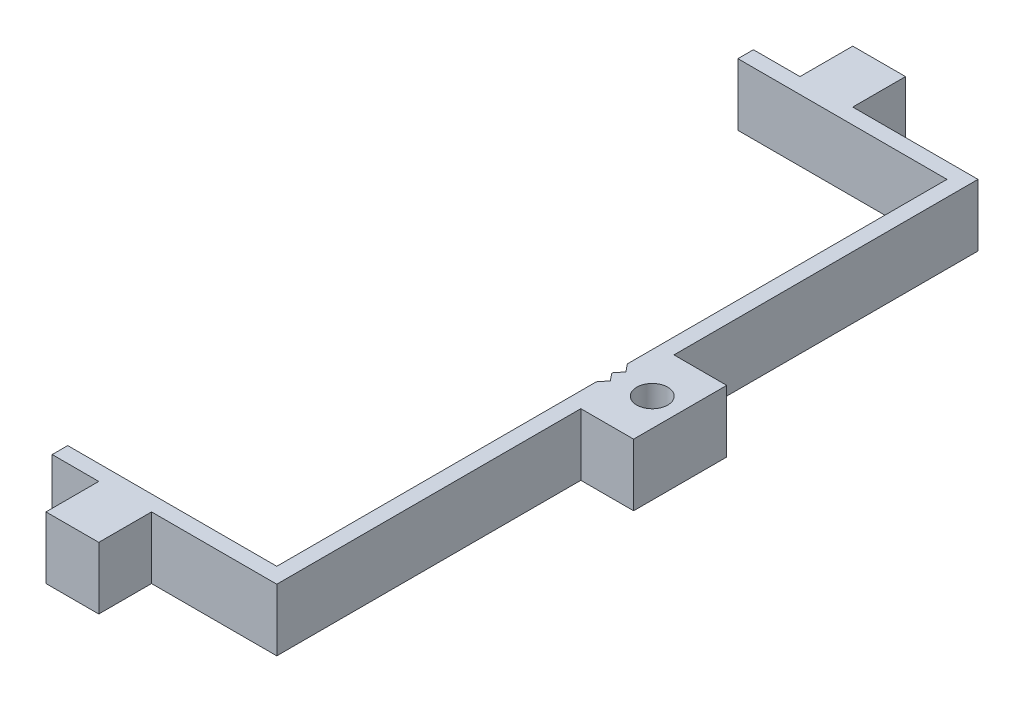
ISO-10303-21;
HEADER;
FILE_DESCRIPTION(('STEP AP214'),'2;1');
FILE_NAME('part.step','',(''),(''),'','','');
FILE_SCHEMA(('AUTOMOTIVE_DESIGN { 1 0 10303 214 1 1 1 1 }'));
ENDSEC;
DATA;
#1=APPLICATION_CONTEXT('core data for automotive mechanical design processes');
#2=APPLICATION_PROTOCOL_DEFINITION('international standard','automotive_design',2000,#1);
#3=PRODUCT_CONTEXT('',#1,'mechanical');
#4=PRODUCT('Part','Part','',(#3));
#5=PRODUCT_RELATED_PRODUCT_CATEGORY('part','',(#4));
#6=PRODUCT_DEFINITION_FORMATION('','',#4);
#7=PRODUCT_DEFINITION_CONTEXT('part definition',#1,'design');
#8=PRODUCT_DEFINITION('design','',#6,#7);
#9=PRODUCT_DEFINITION_SHAPE('','',#8);
#10=(LENGTH_UNIT() NAMED_UNIT(*) SI_UNIT(.MILLI.,.METRE.));
#11=(NAMED_UNIT(*) PLANE_ANGLE_UNIT() SI_UNIT($,.RADIAN.));
#12=(NAMED_UNIT(*) SI_UNIT($,.STERADIAN.) SOLID_ANGLE_UNIT());
#13=UNCERTAINTY_MEASURE_WITH_UNIT(LENGTH_MEASURE(1.E-05),#10,'distance_accuracy_value','');
#14=(GEOMETRIC_REPRESENTATION_CONTEXT(3) GLOBAL_UNCERTAINTY_ASSIGNED_CONTEXT((#13)) GLOBAL_UNIT_ASSIGNED_CONTEXT((#10,
#11,#12)) REPRESENTATION_CONTEXT('',''));
#15=CARTESIAN_POINT('',(0.,0.,0.));
#16=DIRECTION('',(0.,0.,1.));
#17=DIRECTION('',(1.,0.,0.));
#18=AXIS2_PLACEMENT_3D('',#15,#16,#17);
#19=CARTESIAN_POINT('',(87.35,-0.00999999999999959,-112.95));
#20=DIRECTION('',(1.,0.,0.));
#21=DIRECTION('',(0.,0.,-1.));
#22=AXIS2_PLACEMENT_3D('',#19,#20,#21);
#23=PLANE('',#22);
#24=DIRECTION('',(0.,1.,0.));
#25=VECTOR('',#24,1.);
#26=CARTESIAN_POINT('',(87.35,-0.00999999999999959,-112.95));
#27=LINE('',#26,#25);
#28=CARTESIAN_POINT('',(87.35,0.,-112.95));
#29=VERTEX_POINT('',#28);
#30=CARTESIAN_POINT('',(87.35,20.,-112.95));
#31=VERTEX_POINT('',#30);
#32=EDGE_CURVE('E11',#29,#31,#27,.T.);
#33=ORIENTED_EDGE('',*,*,#32,.T.);
#34=DIRECTION('',(0.,0.,-1.));
#35=VECTOR('',#34,1.);
#36=CARTESIAN_POINT('',(87.35,20.,0.));
#37=LINE('',#36,#35);
#38=CARTESIAN_POINT('',(87.35,20.,-129.95));
#39=VERTEX_POINT('',#38);
#40=EDGE_CURVE('E391',#31,#39,#37,.T.);
#41=ORIENTED_EDGE('',*,*,#40,.T.);
#42=DIRECTION('',(0.,-1.,0.));
#43=VECTOR('',#42,1.);
#44=CARTESIAN_POINT('',(87.35,20.,-129.95));
#45=LINE('',#44,#43);
#46=CARTESIAN_POINT('',(87.35,0.,-129.95));
#47=VERTEX_POINT('',#46);
#48=EDGE_CURVE('E365',#39,#47,#45,.T.);
#49=ORIENTED_EDGE('',*,*,#48,.T.);
#50=DIRECTION('',(0.,0.,-1.));
#51=VECTOR('',#50,1.);
#52=CARTESIAN_POINT('',(87.35,0.,0.));
#53=LINE('',#52,#51);
#54=EDGE_CURVE('E358',#29,#47,#53,.T.);
#55=ORIENTED_EDGE('',*,*,#54,.F.);
#56=EDGE_LOOP('',(#33,#41,#49,#55));
#57=FACE_BOUND('',#56,.T.);
#58=ADVANCED_FACE('F37',(#57),#23,.F.);
#59=CARTESIAN_POINT('',(72.35,-0.00999999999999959,-112.95));
#60=DIRECTION('',(1.,0.,0.));
#61=DIRECTION('',(0.,0.,-1.));
#62=AXIS2_PLACEMENT_3D('',#59,#60,#61);
#63=PLANE('',#62);
#64=DIRECTION('',(0.,1.,0.));
#65=VECTOR('',#64,1.);
#66=CARTESIAN_POINT('',(72.35,20.,-107.95));
#67=LINE('',#66,#65);
#68=CARTESIAN_POINT('',(72.35,0.,-107.95));
#69=VERTEX_POINT('',#68);
#70=CARTESIAN_POINT('',(72.35,20.,-107.95));
#71=VERTEX_POINT('',#70);
#72=EDGE_CURVE('E368',#69,#71,#67,.T.);
#73=ORIENTED_EDGE('',*,*,#72,.T.);
#74=DIRECTION('',(0.,0.,-1.));
#75=VECTOR('',#74,1.);
#76=CARTESIAN_POINT('',(72.35,20.,0.));
#77=LINE('',#76,#75);
#78=CARTESIAN_POINT('',(72.35,20.,-112.95));
#79=VERTEX_POINT('',#78);
#80=EDGE_CURVE('E390',#71,#79,#77,.T.);
#81=ORIENTED_EDGE('',*,*,#80,.T.);
#82=DIRECTION('',(0.,1.,0.));
#83=VECTOR('',#82,1.);
#84=CARTESIAN_POINT('',(72.35,-0.00999999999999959,-112.95));
#85=LINE('',#84,#83);
#86=CARTESIAN_POINT('',(72.35,0.,-112.95));
#87=VERTEX_POINT('',#86);
#88=EDGE_CURVE('E46',#87,#79,#85,.T.);
#89=ORIENTED_EDGE('',*,*,#88,.F.);
#90=DIRECTION('',(0.,0.,-1.));
#91=VECTOR('',#90,1.);
#92=CARTESIAN_POINT('',(72.35,0.,0.));
#93=LINE('',#92,#91);
#94=EDGE_CURVE('E381',#69,#87,#93,.T.);
#95=ORIENTED_EDGE('',*,*,#94,.F.);
#96=EDGE_LOOP('',(#73,#81,#89,#95));
#97=FACE_BOUND('',#96,.T.);
#98=ADVANCED_FACE('F416',(#97),#63,.F.);
#99=CARTESIAN_POINT('',(72.35,-0.00999999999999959,-112.95));
#100=DIRECTION('',(0.,0.,1.));
#101=DIRECTION('',(1.,0.,0.));
#102=AXIS2_PLACEMENT_3D('',#99,#100,#101);
#103=PLANE('',#102);
#104=ORIENTED_EDGE('',*,*,#88,.T.);
#105=DIRECTION('',(1.,0.,0.));
#106=VECTOR('',#105,1.);
#107=CARTESIAN_POINT('',(0.,20.,-112.95));
#108=LINE('',#107,#106);
#109=EDGE_CURVE('E394',#79,#31,#108,.T.);
#110=ORIENTED_EDGE('',*,*,#109,.T.);
#111=ORIENTED_EDGE('',*,*,#32,.F.);
#112=DIRECTION('',(1.,0.,0.));
#113=VECTOR('',#112,1.);
#114=CARTESIAN_POINT('',(0.,0.,-112.95));
#115=LINE('',#114,#113);
#116=EDGE_CURVE('E378',#87,#29,#115,.T.);
#117=ORIENTED_EDGE('',*,*,#116,.F.);
#118=EDGE_LOOP('',(#104,#110,#111,#117));
#119=FACE_BOUND('',#118,.T.);
#120=ADVANCED_FACE('F415',(#119),#103,.F.);
#121=CARTESIAN_POINT('',(72.35,-0.00999999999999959,112.95));
#122=DIRECTION('',(-1.,0.,0.));
#123=DIRECTION('',(0.,0.,1.));
#124=AXIS2_PLACEMENT_3D('',#121,#122,#123);
#125=PLANE('',#124);
#126=DIRECTION('',(0.,-1.,0.));
#127=VECTOR('',#126,1.);
#128=CARTESIAN_POINT('',(72.35,20.,107.95));
#129=LINE('',#128,#127);
#130=CARTESIAN_POINT('',(72.35,20.,107.95));
#131=VERTEX_POINT('',#130);
#132=CARTESIAN_POINT('',(72.35,0.,107.95));
#133=VERTEX_POINT('',#132);
#134=EDGE_CURVE('E371',#131,#133,#129,.T.);
#135=ORIENTED_EDGE('',*,*,#134,.T.);
#136=DIRECTION('',(0.,0.,1.));
#137=VECTOR('',#136,1.);
#138=CARTESIAN_POINT('',(72.35,0.,0.));
#139=LINE('',#138,#137);
#140=CARTESIAN_POINT('',(72.35,0.,112.95));
#141=VERTEX_POINT('',#140);
#142=EDGE_CURVE('E41',#133,#141,#139,.T.);
#143=ORIENTED_EDGE('',*,*,#142,.T.);
#144=DIRECTION('',(0.,1.,0.));
#145=VECTOR('',#144,1.);
#146=CARTESIAN_POINT('',(72.35,-0.00999999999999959,112.95));
#147=LINE('',#146,#145);
#148=CARTESIAN_POINT('',(72.35,20.,112.95));
#149=VERTEX_POINT('',#148);
#150=EDGE_CURVE('E402',#141,#149,#147,.T.);
#151=ORIENTED_EDGE('',*,*,#150,.T.);
#152=DIRECTION('',(0.,0.,1.));
#153=VECTOR('',#152,1.);
#154=CARTESIAN_POINT('',(72.35,20.,0.));
#155=LINE('',#154,#153);
#156=EDGE_CURVE('E387',#131,#149,#155,.T.);
#157=ORIENTED_EDGE('',*,*,#156,.F.);
#158=EDGE_LOOP('',(#135,#143,#151,#157));
#159=FACE_BOUND('',#158,.T.);
#160=ADVANCED_FACE('F39',(#159),#125,.T.);
#161=CARTESIAN_POINT('',(87.35,-0.00999999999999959,112.95));
#162=DIRECTION('',(-1.,0.,0.));
#163=DIRECTION('',(0.,0.,1.));
#164=AXIS2_PLACEMENT_3D('',#161,#162,#163);
#165=PLANE('',#164);
#166=DIRECTION('',(0.,1.,0.));
#167=VECTOR('',#166,1.);
#168=CARTESIAN_POINT('',(87.35,-0.00999999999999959,112.95));
#169=LINE('',#168,#167);
#170=CARTESIAN_POINT('',(87.35,0.,112.95));
#171=VERTEX_POINT('',#170);
#172=CARTESIAN_POINT('',(87.35,20.,112.95));
#173=VERTEX_POINT('',#172);
#174=EDGE_CURVE('E400',#171,#173,#169,.T.);
#175=ORIENTED_EDGE('',*,*,#174,.F.);
#176=DIRECTION('',(0.,0.,1.));
#177=VECTOR('',#176,1.);
#178=CARTESIAN_POINT('',(87.35,0.,0.));
#179=LINE('',#178,#177);
#180=CARTESIAN_POINT('',(87.35,0.,129.95));
#181=VERTEX_POINT('',#180);
#182=EDGE_CURVE('E374',#171,#181,#179,.T.);
#183=ORIENTED_EDGE('',*,*,#182,.T.);
#184=DIRECTION('',(0.,1.,0.));
#185=VECTOR('',#184,1.);
#186=CARTESIAN_POINT('',(87.35,20.,129.95));
#187=LINE('',#186,#185);
#188=CARTESIAN_POINT('',(87.35,20.,129.95));
#189=VERTEX_POINT('',#188);
#190=EDGE_CURVE('E362',#181,#189,#187,.T.);
#191=ORIENTED_EDGE('',*,*,#190,.T.);
#192=DIRECTION('',(0.,0.,1.));
#193=VECTOR('',#192,1.);
#194=CARTESIAN_POINT('',(87.35,20.,0.));
#195=LINE('',#194,#193);
#196=EDGE_CURVE('E382',#173,#189,#195,.T.);
#197=ORIENTED_EDGE('',*,*,#196,.F.);
#198=EDGE_LOOP('',(#175,#183,#191,#197));
#199=FACE_BOUND('',#198,.T.);
#200=ADVANCED_FACE('F462',(#199),#165,.T.);
#201=CARTESIAN_POINT('',(72.35,-0.00999999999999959,112.95));
#202=DIRECTION('',(0.,0.,1.));
#203=DIRECTION('',(1.,0.,0.));
#204=AXIS2_PLACEMENT_3D('',#201,#202,#203);
#205=PLANE('',#204);
#206=ORIENTED_EDGE('',*,*,#150,.F.);
#207=DIRECTION('',(1.,0.,0.));
#208=VECTOR('',#207,1.);
#209=CARTESIAN_POINT('',(0.,0.,112.95));
#210=LINE('',#209,#208);
#211=EDGE_CURVE('E375',#141,#171,#210,.T.);
#212=ORIENTED_EDGE('',*,*,#211,.T.);
#213=ORIENTED_EDGE('',*,*,#174,.T.);
#214=DIRECTION('',(1.,0.,0.));
#215=VECTOR('',#214,1.);
#216=CARTESIAN_POINT('',(0.,20.,112.95));
#217=LINE('',#216,#215);
#218=EDGE_CURVE('E384',#149,#173,#217,.T.);
#219=ORIENTED_EDGE('',*,*,#218,.F.);
#220=EDGE_LOOP('',(#206,#212,#213,#219));
#221=FACE_BOUND('',#220,.T.);
#222=ADVANCED_FACE('F465',(#221),#205,.T.);
#223=CARTESIAN_POINT('',(0.,20.,107.95));
#224=DIRECTION('',(0.,0.,1.));
#225=DIRECTION('',(1.,0.,0.));
#226=AXIS2_PLACEMENT_3D('',#223,#224,#225);
#227=PLANE('',#226);
#228=ORIENTED_EDGE('',*,*,#134,.F.);
#229=DIRECTION('',(-1.,0.,0.));
#230=VECTOR('',#229,1.);
#231=CARTESIAN_POINT('',(0.,20.,107.95));
#232=LINE('',#231,#230);
#233=CARTESIAN_POINT('',(139.7,20.,107.95));
#234=VERTEX_POINT('',#233);
#235=EDGE_CURVE('E317',#234,#131,#232,.T.);
#236=ORIENTED_EDGE('',*,*,#235,.F.);
#237=DIRECTION('',(0.,-1.,0.));
#238=VECTOR('',#237,1.);
#239=CARTESIAN_POINT('',(139.7,20.,107.95));
#240=LINE('',#239,#238);
#241=CARTESIAN_POINT('',(139.7,0.,107.95));
#242=VERTEX_POINT('',#241);
#243=EDGE_CURVE('E330',#234,#242,#240,.T.);
#244=ORIENTED_EDGE('',*,*,#243,.T.);
#245=DIRECTION('',(-1.,0.,0.));
#246=VECTOR('',#245,1.);
#247=CARTESIAN_POINT('',(0.,0.,107.95));
#248=LINE('',#247,#246);
#249=EDGE_CURVE('E338',#242,#133,#248,.T.);
#250=ORIENTED_EDGE('',*,*,#249,.T.);
#251=EDGE_LOOP('',(#228,#236,#244,#250));
#252=FACE_BOUND('',#251,.T.);
#253=ADVANCED_FACE('F468',(#252),#227,.F.);
#254=CARTESIAN_POINT('',(0.,20.,129.95));
#255=DIRECTION('',(0.,0.,-1.));
#256=DIRECTION('',(-1.,0.,0.));
#257=AXIS2_PLACEMENT_3D('',#254,#255,#256);
#258=PLANE('',#257);
#259=ORIENTED_EDGE('',*,*,#190,.F.);
#260=DIRECTION('',(1.,0.,0.));
#261=VECTOR('',#260,1.);
#262=CARTESIAN_POINT('',(0.,0.,129.95));
#263=LINE('',#262,#261);
#264=CARTESIAN_POINT('',(104.35,0.,129.95));
#265=VERTEX_POINT('',#264);
#266=EDGE_CURVE('E54',#181,#265,#263,.T.);
#267=ORIENTED_EDGE('',*,*,#266,.T.);
#268=DIRECTION('',(0.,-1.,0.));
#269=VECTOR('',#268,1.);
#270=CARTESIAN_POINT('',(104.35,20.,129.95));
#271=LINE('',#270,#269);
#272=CARTESIAN_POINT('',(104.35,20.,129.95));
#273=VERTEX_POINT('',#272);
#274=EDGE_CURVE('E257',#273,#265,#271,.T.);
#275=ORIENTED_EDGE('',*,*,#274,.F.);
#276=DIRECTION('',(1.,0.,0.));
#277=VECTOR('',#276,1.);
#278=CARTESIAN_POINT('',(0.,20.,129.95));
#279=LINE('',#278,#277);
#280=EDGE_CURVE('E62',#189,#273,#279,.T.);
#281=ORIENTED_EDGE('',*,*,#280,.F.);
#282=EDGE_LOOP('',(#259,#267,#275,#281));
#283=FACE_BOUND('',#282,.T.);
#284=ADVANCED_FACE('F473',(#283),#258,.F.);
#285=CARTESIAN_POINT('',(152.7,20.,0.));
#286=DIRECTION('',(0.,-1.,0.));
#287=DIRECTION('',(0.,0.,-1.));
#288=AXIS2_PLACEMENT_3D('',#285,#286,#287);
#289=CYLINDRICAL_SURFACE('',#288,2.);
#290=CARTESIAN_POINT('',(152.7,0.,0.));
#291=DIRECTION('',(0.,1.,0.));
#292=DIRECTION('',(0.,0.,1.));
#293=AXIS2_PLACEMENT_3D('',#290,#291,#292);
#294=CIRCLE('',#293,2.);
#295=CARTESIAN_POINT('',(152.7,0.,2.));
#296=VERTEX_POINT('',#295);
#297=EDGE_CURVE('E231',#296,#296,#294,.T.);
#298=ORIENTED_EDGE('',*,*,#297,.F.);
#299=EDGE_LOOP('',(#298));
#300=FACE_BOUND('',#299,.T.);
#301=CARTESIAN_POINT('',(152.7,10.,0.));
#302=DIRECTION('',(0.,1.,0.));
#303=DIRECTION('',(0.,0.,1.));
#304=AXIS2_PLACEMENT_3D('',#301,#302,#303);
#305=CIRCLE('',#304,2.);
#306=CARTESIAN_POINT('',(152.7,10.,2.));
#307=VERTEX_POINT('',#306);
#308=EDGE_CURVE('E404',#307,#307,#305,.T.);
#309=ORIENTED_EDGE('',*,*,#308,.T.);
#310=EDGE_LOOP('',(#309));
#311=FACE_BOUND('',#310,.T.);
#312=ADVANCED_FACE('F487',(#300,#311),#289,.F.);
#313=CARTESIAN_POINT('',(144.7,20.,0.));
#314=DIRECTION('',(1.,0.,0.));
#315=DIRECTION('',(0.,0.,-1.));
#316=AXIS2_PLACEMENT_3D('',#313,#314,#315);
#317=PLANE('',#316);
#318=DIRECTION('',(0.,0.,1.));
#319=VECTOR('',#318,1.);
#320=CARTESIAN_POINT('',(144.7,20.,0.));
#321=LINE('',#320,#319);
#322=CARTESIAN_POINT('',(144.7,20.,-112.95));
#323=VERTEX_POINT('',#322);
#324=CARTESIAN_POINT('',(144.7,20.,-15.));
#325=VERTEX_POINT('',#324);
#326=EDGE_CURVE('E319',#323,#325,#321,.T.);
#327=ORIENTED_EDGE('',*,*,#326,.T.);
#328=DIRECTION('',(0.,-1.,0.));
#329=VECTOR('',#328,1.);
#330=CARTESIAN_POINT('',(144.7,20.,-15.));
#331=LINE('',#330,#329);
#332=CARTESIAN_POINT('',(144.7,0.,-15.));
#333=VERTEX_POINT('',#332);
#334=EDGE_CURVE('E250',#325,#333,#331,.T.);
#335=ORIENTED_EDGE('',*,*,#334,.T.);
#336=DIRECTION('',(0.,0.,1.));
#337=VECTOR('',#336,1.);
#338=CARTESIAN_POINT('',(144.7,0.,0.));
#339=LINE('',#338,#337);
#340=CARTESIAN_POINT('',(144.7,0.,-112.95));
#341=VERTEX_POINT('',#340);
#342=EDGE_CURVE('E341',#341,#333,#339,.T.);
#343=ORIENTED_EDGE('',*,*,#342,.F.);
#344=DIRECTION('',(0.,-1.,0.));
#345=VECTOR('',#344,1.);
#346=CARTESIAN_POINT('',(144.7,20.,-112.95));
#347=LINE('',#346,#345);
#348=EDGE_CURVE('E355',#323,#341,#347,.T.);
#349=ORIENTED_EDGE('',*,*,#348,.F.);
#350=EDGE_LOOP('',(#327,#335,#343,#349));
#351=FACE_BOUND('',#350,.T.);
#352=ADVANCED_FACE('F435',(#351),#317,.T.);
#353=CARTESIAN_POINT('',(0.,20.,-112.95));
#354=DIRECTION('',(0.,0.,1.));
#355=DIRECTION('',(1.,0.,0.));
#356=AXIS2_PLACEMENT_3D('',#353,#354,#355);
#357=PLANE('',#356);
#358=DIRECTION('',(0.,-1.,0.));
#359=VECTOR('',#358,1.);
#360=CARTESIAN_POINT('',(104.35,20.,-112.95));
#361=LINE('',#360,#359);
#362=CARTESIAN_POINT('',(104.35,20.,-112.95));
#363=VERTEX_POINT('',#362);
#364=CARTESIAN_POINT('',(104.35,0.,-112.95));
#365=VERTEX_POINT('',#364);
#366=EDGE_CURVE('E273',#363,#365,#361,.T.);
#367=ORIENTED_EDGE('',*,*,#366,.F.);
#368=DIRECTION('',(-1.,0.,0.));
#369=VECTOR('',#368,1.);
#370=CARTESIAN_POINT('',(0.,20.,-112.95));
#371=LINE('',#370,#369);
#372=EDGE_CURVE('E322',#323,#363,#371,.T.);
#373=ORIENTED_EDGE('',*,*,#372,.F.);
#374=ORIENTED_EDGE('',*,*,#348,.T.);
#375=DIRECTION('',(-1.,0.,0.));
#376=VECTOR('',#375,1.);
#377=CARTESIAN_POINT('',(0.,0.,-112.95));
#378=LINE('',#377,#376);
#379=EDGE_CURVE('E344',#341,#365,#378,.T.);
#380=ORIENTED_EDGE('',*,*,#379,.T.);
#381=EDGE_LOOP('',(#367,#373,#374,#380));
#382=FACE_BOUND('',#381,.T.);
#383=ADVANCED_FACE('F432',(#382),#357,.F.);
#384=CARTESIAN_POINT('',(0.,20.,0.));
#385=DIRECTION('',(0.,1.,0.));
#386=DIRECTION('',(0.,0.,1.));
#387=AXIS2_PLACEMENT_3D('',#384,#385,#386);
#388=PLANE('',#387);
#389=ORIENTED_EDGE('',*,*,#80,.F.);
#390=DIRECTION('',(-1.,0.,0.));
#391=VECTOR('',#390,1.);
#392=CARTESIAN_POINT('',(0.,20.,-107.95));
#393=LINE('',#392,#391);
#394=CARTESIAN_POINT('',(139.7,20.,-107.95));
#395=VERTEX_POINT('',#394);
#396=EDGE_CURVE('E309',#395,#71,#393,.T.);
#397=ORIENTED_EDGE('',*,*,#396,.F.);
#398=DIRECTION('',(0.,0.,-1.));
#399=VECTOR('',#398,1.);
#400=CARTESIAN_POINT('',(139.7,20.,0.));
#401=LINE('',#400,#399);
#402=CARTESIAN_POINT('',(139.7,20.,-5.));
#403=VERTEX_POINT('',#402);
#404=EDGE_CURVE('E312',#403,#395,#401,.T.);
#405=ORIENTED_EDGE('',*,*,#404,.F.);
#406=DIRECTION('',(-0.624695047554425,0.,-0.78086880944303));
#407=VECTOR('',#406,1.);
#408=CARTESIAN_POINT('',(141.7,20.,-2.5));
#409=LINE('',#408,#407);
#410=CARTESIAN_POINT('',(141.7,20.,-2.5));
#411=VERTEX_POINT('',#410);
#412=EDGE_CURVE('E294',#411,#403,#409,.T.);
#413=ORIENTED_EDGE('',*,*,#412,.F.);
#414=DIRECTION('',(0.624695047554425,0.,-0.78086880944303));
#415=VECTOR('',#414,1.);
#416=CARTESIAN_POINT('',(139.7,20.,0.));
#417=LINE('',#416,#415);
#418=CARTESIAN_POINT('',(139.7,20.,0.));
#419=VERTEX_POINT('',#418);
#420=EDGE_CURVE('E288',#419,#411,#417,.T.);
#421=ORIENTED_EDGE('',*,*,#420,.F.);
#422=DIRECTION('',(0.624695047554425,0.,0.78086880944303));
#423=VECTOR('',#422,1.);
#424=CARTESIAN_POINT('',(139.7,20.,0.));
#425=LINE('',#424,#423);
#426=CARTESIAN_POINT('',(141.7,20.,2.5));
#427=VERTEX_POINT('',#426);
#428=EDGE_CURVE('E279',#419,#427,#425,.T.);
#429=ORIENTED_EDGE('',*,*,#428,.T.);
#430=DIRECTION('',(-0.624695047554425,0.,0.78086880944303));
#431=VECTOR('',#430,1.);
#432=CARTESIAN_POINT('',(141.7,20.,2.5));
#433=LINE('',#432,#431);
#434=CARTESIAN_POINT('',(139.7,20.,5.));
#435=VERTEX_POINT('',#434);
#436=EDGE_CURVE('E275',#427,#435,#433,.T.);
#437=ORIENTED_EDGE('',*,*,#436,.T.);
#438=EDGE_CURVE('E314',#234,#435,#401,.T.);
#439=ORIENTED_EDGE('',*,*,#438,.F.);
#440=ORIENTED_EDGE('',*,*,#235,.T.);
#441=ORIENTED_EDGE('',*,*,#156,.T.);
#442=ORIENTED_EDGE('',*,*,#218,.T.);
#443=ORIENTED_EDGE('',*,*,#196,.T.);
#444=ORIENTED_EDGE('',*,*,#280,.T.);
#445=DIRECTION('',(0.,0.,1.));
#446=VECTOR('',#445,1.);
#447=CARTESIAN_POINT('',(104.35,20.,0.));
#448=LINE('',#447,#446);
#449=CARTESIAN_POINT('',(104.35,20.,112.95));
#450=VERTEX_POINT('',#449);
#451=EDGE_CURVE('E254',#450,#273,#448,.T.);
#452=ORIENTED_EDGE('',*,*,#451,.F.);
#453=DIRECTION('',(-1.,0.,0.));
#454=VECTOR('',#453,1.);
#455=CARTESIAN_POINT('',(0.,20.,112.95));
#456=LINE('',#455,#454);
#457=CARTESIAN_POINT('',(144.7,20.,112.95));
#458=VERTEX_POINT('',#457);
#459=EDGE_CURVE('E327',#458,#450,#456,.T.);
#460=ORIENTED_EDGE('',*,*,#459,.F.);
#461=CARTESIAN_POINT('',(144.7,20.,15.));
#462=VERTEX_POINT('',#461);
#463=EDGE_CURVE('E230',#462,#458,#321,.T.);
#464=ORIENTED_EDGE('',*,*,#463,.F.);
#465=DIRECTION('',(-1.,0.,0.));
#466=VECTOR('',#465,1.);
#467=CARTESIAN_POINT('',(0.,20.,15.));
#468=LINE('',#467,#466);
#469=CARTESIAN_POINT('',(161.7,20.,15.));
#470=VERTEX_POINT('',#469);
#471=EDGE_CURVE('E210',#470,#462,#468,.T.);
#472=ORIENTED_EDGE('',*,*,#471,.F.);
#473=DIRECTION('',(0.,0.,1.));
#474=VECTOR('',#473,1.);
#475=CARTESIAN_POINT('',(161.7,20.,0.));
#476=LINE('',#475,#474);
#477=CARTESIAN_POINT('',(161.7,20.,-15.));
#478=VERTEX_POINT('',#477);
#479=EDGE_CURVE('E227',#478,#470,#476,.T.);
#480=ORIENTED_EDGE('',*,*,#479,.F.);
#481=DIRECTION('',(1.,0.,0.));
#482=VECTOR('',#481,1.);
#483=CARTESIAN_POINT('',(0.,20.,-15.));
#484=LINE('',#483,#482);
#485=EDGE_CURVE('E234',#325,#478,#484,.T.);
#486=ORIENTED_EDGE('',*,*,#485,.F.);
#487=ORIENTED_EDGE('',*,*,#326,.F.);
#488=ORIENTED_EDGE('',*,*,#372,.T.);
#489=DIRECTION('',(0.,0.,-1.));
#490=VECTOR('',#489,1.);
#491=CARTESIAN_POINT('',(104.35,20.,0.));
#492=LINE('',#491,#490);
#493=CARTESIAN_POINT('',(104.35,20.,-129.95));
#494=VERTEX_POINT('',#493);
#495=EDGE_CURVE('E265',#363,#494,#492,.T.);
#496=ORIENTED_EDGE('',*,*,#495,.T.);
#497=DIRECTION('',(1.,0.,0.));
#498=VECTOR('',#497,1.);
#499=CARTESIAN_POINT('',(0.,20.,-129.95));
#500=LINE('',#499,#498);
#501=EDGE_CURVE('E325',#39,#494,#500,.T.);
#502=ORIENTED_EDGE('',*,*,#501,.F.);
#503=ORIENTED_EDGE('',*,*,#40,.F.);
#504=ORIENTED_EDGE('',*,*,#109,.F.);
#505=EDGE_LOOP('',(#389,#397,#405,#413,#421,#429,#437,#439,#440,#441,#442,#443,#444,#452,#460,
#464,#472,#480,#486,#487,#488,#496,#502,#503,#504));
#506=FACE_BOUND('',#505,.T.);
#507=CARTESIAN_POINT('',(152.7,20.,0.));
#508=DIRECTION('',(0.,1.,0.));
#509=DIRECTION('',(0.,0.,1.));
#510=AXIS2_PLACEMENT_3D('',#507,#508,#509);
#511=CIRCLE('',#510,5.00000000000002);
#512=CARTESIAN_POINT('',(152.7,20.,5.00000000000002));
#513=VERTEX_POINT('',#512);
#514=EDGE_CURVE('E500',#513,#513,#511,.T.);
#515=ORIENTED_EDGE('',*,*,#514,.F.);
#516=EDGE_LOOP('',(#515));
#517=FACE_BOUND('',#516,.T.);
#518=ADVANCED_FACE('F224',(#506,#517),#388,.T.);
#519=CARTESIAN_POINT('',(0.,0.,0.));
#520=DIRECTION('',(0.,1.,0.));
#521=DIRECTION('',(0.,0.,1.));
#522=AXIS2_PLACEMENT_3D('',#519,#520,#521);
#523=PLANE('',#522);
#524=DIRECTION('',(-1.,0.,0.));
#525=VECTOR('',#524,1.);
#526=CARTESIAN_POINT('',(0.,0.,-107.95));
#527=LINE('',#526,#525);
#528=CARTESIAN_POINT('',(139.7,0.,-107.95));
#529=VERTEX_POINT('',#528);
#530=EDGE_CURVE('E304',#529,#69,#527,.T.);
#531=ORIENTED_EDGE('',*,*,#530,.T.);
#532=ORIENTED_EDGE('',*,*,#94,.T.);
#533=ORIENTED_EDGE('',*,*,#116,.T.);
#534=ORIENTED_EDGE('',*,*,#54,.T.);
#535=DIRECTION('',(1.,0.,0.));
#536=VECTOR('',#535,1.);
#537=CARTESIAN_POINT('',(0.,0.,-129.95));
#538=LINE('',#537,#536);
#539=CARTESIAN_POINT('',(104.35,0.,-129.95));
#540=VERTEX_POINT('',#539);
#541=EDGE_CURVE('E347',#47,#540,#538,.T.);
#542=ORIENTED_EDGE('',*,*,#541,.T.);
#543=DIRECTION('',(0.,0.,-1.));
#544=VECTOR('',#543,1.);
#545=CARTESIAN_POINT('',(104.35,0.,0.));
#546=LINE('',#545,#544);
#547=EDGE_CURVE('E264',#365,#540,#546,.T.);
#548=ORIENTED_EDGE('',*,*,#547,.F.);
#549=ORIENTED_EDGE('',*,*,#379,.F.);
#550=ORIENTED_EDGE('',*,*,#342,.T.);
#551=DIRECTION('',(1.,0.,0.));
#552=VECTOR('',#551,1.);
#553=CARTESIAN_POINT('',(0.,0.,-15.));
#554=LINE('',#553,#552);
#555=CARTESIAN_POINT('',(161.7,0.,-15.));
#556=VERTEX_POINT('',#555);
#557=EDGE_CURVE('E244',#333,#556,#554,.T.);
#558=ORIENTED_EDGE('',*,*,#557,.T.);
#559=DIRECTION('',(0.,0.,1.));
#560=VECTOR('',#559,1.);
#561=CARTESIAN_POINT('',(161.7,0.,0.));
#562=LINE('',#561,#560);
#563=CARTESIAN_POINT('',(161.7,0.,15.));
#564=VERTEX_POINT('',#563);
#565=EDGE_CURVE('E241',#556,#564,#562,.T.);
#566=ORIENTED_EDGE('',*,*,#565,.T.);
#567=DIRECTION('',(-1.,0.,0.));
#568=VECTOR('',#567,1.);
#569=CARTESIAN_POINT('',(0.,0.,15.));
#570=LINE('',#569,#568);
#571=CARTESIAN_POINT('',(144.7,0.,15.));
#572=VERTEX_POINT('',#571);
#573=EDGE_CURVE('E213',#564,#572,#570,.T.);
#574=ORIENTED_EDGE('',*,*,#573,.T.);
#575=CARTESIAN_POINT('',(144.7,0.,112.95));
#576=VERTEX_POINT('',#575);
#577=EDGE_CURVE('E340',#572,#576,#339,.T.);
#578=ORIENTED_EDGE('',*,*,#577,.T.);
#579=DIRECTION('',(-1.,0.,0.));
#580=VECTOR('',#579,1.);
#581=CARTESIAN_POINT('',(0.,0.,112.95));
#582=LINE('',#581,#580);
#583=CARTESIAN_POINT('',(104.35,0.,112.95));
#584=VERTEX_POINT('',#583);
#585=EDGE_CURVE('E313',#576,#584,#582,.T.);
#586=ORIENTED_EDGE('',*,*,#585,.T.);
#587=DIRECTION('',(0.,0.,1.));
#588=VECTOR('',#587,1.);
#589=CARTESIAN_POINT('',(104.35,0.,0.));
#590=LINE('',#589,#588);
#591=EDGE_CURVE('E218',#584,#265,#590,.T.);
#592=ORIENTED_EDGE('',*,*,#591,.T.);
#593=ORIENTED_EDGE('',*,*,#266,.F.);
#594=ORIENTED_EDGE('',*,*,#182,.F.);
#595=ORIENTED_EDGE('',*,*,#211,.F.);
#596=ORIENTED_EDGE('',*,*,#142,.F.);
#597=ORIENTED_EDGE('',*,*,#249,.F.);
#598=DIRECTION('',(0.,0.,-1.));
#599=VECTOR('',#598,1.);
#600=CARTESIAN_POINT('',(139.7,0.,0.));
#601=LINE('',#600,#599);
#602=CARTESIAN_POINT('',(139.7,0.,5.));
#603=VERTEX_POINT('',#602);
#604=EDGE_CURVE('E335',#242,#603,#601,.T.);
#605=ORIENTED_EDGE('',*,*,#604,.T.);
#606=DIRECTION('',(-0.624695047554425,0.,0.78086880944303));
#607=VECTOR('',#606,1.);
#608=CARTESIAN_POINT('',(141.7,0.,2.5));
#609=LINE('',#608,#607);
#610=CARTESIAN_POINT('',(141.7,0.,2.5));
#611=VERTEX_POINT('',#610);
#612=EDGE_CURVE('E276',#611,#603,#609,.T.);
#613=ORIENTED_EDGE('',*,*,#612,.F.);
#614=DIRECTION('',(0.624695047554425,0.,0.78086880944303));
#615=VECTOR('',#614,1.);
#616=CARTESIAN_POINT('',(139.7,0.,0.));
#617=LINE('',#616,#615);
#618=CARTESIAN_POINT('',(139.7,0.,0.));
#619=VERTEX_POINT('',#618);
#620=EDGE_CURVE('E278',#619,#611,#617,.T.);
#621=ORIENTED_EDGE('',*,*,#620,.F.);
#622=DIRECTION('',(0.624695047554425,0.,-0.78086880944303));
#623=VECTOR('',#622,1.);
#624=CARTESIAN_POINT('',(139.7,0.,0.));
#625=LINE('',#624,#623);
#626=CARTESIAN_POINT('',(141.7,0.,-2.5));
#627=VERTEX_POINT('',#626);
#628=EDGE_CURVE('E290',#619,#627,#625,.T.);
#629=ORIENTED_EDGE('',*,*,#628,.T.);
#630=DIRECTION('',(-0.624695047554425,0.,-0.78086880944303));
#631=VECTOR('',#630,1.);
#632=CARTESIAN_POINT('',(141.7,0.,-2.5));
#633=LINE('',#632,#631);
#634=CARTESIAN_POINT('',(139.7,0.,-5.));
#635=VERTEX_POINT('',#634);
#636=EDGE_CURVE('E293',#627,#635,#633,.T.);
#637=ORIENTED_EDGE('',*,*,#636,.T.);
#638=EDGE_CURVE('E334',#635,#529,#601,.T.);
#639=ORIENTED_EDGE('',*,*,#638,.T.);
#640=EDGE_LOOP('',(#531,#532,#533,#534,#542,#548,#549,#550,#558,#566,#574,#578,#586,#592,#593,
#594,#595,#596,#597,#605,#613,#621,#629,#637,#639));
#641=FACE_BOUND('',#640,.T.);
#642=ORIENTED_EDGE('',*,*,#297,.T.);
#643=EDGE_LOOP('',(#642));
#644=FACE_BOUND('',#643,.T.);
#645=ADVANCED_FACE('F407',(#641,#644),#523,.F.);
#646=CARTESIAN_POINT('',(139.7,20.,0.));
#647=DIRECTION('',(-1.,0.,0.));
#648=DIRECTION('',(0.,0.,1.));
#649=AXIS2_PLACEMENT_3D('',#646,#647,#648);
#650=PLANE('',#649);
#651=ORIENTED_EDGE('',*,*,#438,.T.);
#652=DIRECTION('',(0.,1.,0.));
#653=VECTOR('',#652,1.);
#654=CARTESIAN_POINT('',(139.7,0.,5.));
#655=LINE('',#654,#653);
#656=EDGE_CURVE('E281',#603,#435,#655,.T.);
#657=ORIENTED_EDGE('',*,*,#656,.F.);
#658=ORIENTED_EDGE('',*,*,#604,.F.);
#659=ORIENTED_EDGE('',*,*,#243,.F.);
#660=EDGE_LOOP('',(#651,#657,#658,#659));
#661=FACE_BOUND('',#660,.T.);
#662=ADVANCED_FACE('F514',(#661),#650,.T.);
#663=CARTESIAN_POINT('',(0.,20.,-107.95));
#664=DIRECTION('',(0.,0.,1.));
#665=DIRECTION('',(1.,0.,0.));
#666=AXIS2_PLACEMENT_3D('',#663,#664,#665);
#667=PLANE('',#666);
#668=ORIENTED_EDGE('',*,*,#72,.F.);
#669=ORIENTED_EDGE('',*,*,#530,.F.);
#670=DIRECTION('',(0.,-1.,0.));
#671=VECTOR('',#670,1.);
#672=CARTESIAN_POINT('',(139.7,20.,-107.95));
#673=LINE('',#672,#671);
#674=EDGE_CURVE('E356',#395,#529,#673,.T.);
#675=ORIENTED_EDGE('',*,*,#674,.F.);
#676=ORIENTED_EDGE('',*,*,#396,.T.);
#677=EDGE_LOOP('',(#668,#669,#675,#676));
#678=FACE_BOUND('',#677,.T.);
#679=ADVANCED_FACE('F459',(#678),#667,.T.);
#680=DIRECTION('',(0.,1.,0.));
#681=VECTOR('',#680,1.);
#682=CARTESIAN_POINT('',(139.7,0.,-5.));
#683=LINE('',#682,#681);
#684=EDGE_CURVE('E301',#635,#403,#683,.T.);
#685=ORIENTED_EDGE('',*,*,#684,.T.);
#686=ORIENTED_EDGE('',*,*,#404,.T.);
#687=ORIENTED_EDGE('',*,*,#674,.T.);
#688=ORIENTED_EDGE('',*,*,#638,.F.);
#689=EDGE_LOOP('',(#685,#686,#687,#688));
#690=FACE_BOUND('',#689,.T.);
#691=ADVANCED_FACE('F528',(#690),#650,.T.);
#692=DIRECTION('',(0.,-1.,0.));
#693=VECTOR('',#692,1.);
#694=CARTESIAN_POINT('',(144.7,20.,15.));
#695=LINE('',#694,#693);
#696=EDGE_CURVE('E236',#462,#572,#695,.T.);
#697=ORIENTED_EDGE('',*,*,#696,.F.);
#698=ORIENTED_EDGE('',*,*,#463,.T.);
#699=DIRECTION('',(0.,-1.,0.));
#700=VECTOR('',#699,1.);
#701=CARTESIAN_POINT('',(144.7,20.,112.95));
#702=LINE('',#701,#700);
#703=EDGE_CURVE('E352',#458,#576,#702,.T.);
#704=ORIENTED_EDGE('',*,*,#703,.T.);
#705=ORIENTED_EDGE('',*,*,#577,.F.);
#706=EDGE_LOOP('',(#697,#698,#704,#705));
#707=FACE_BOUND('',#706,.T.);
#708=ADVANCED_FACE('F495',(#707),#317,.T.);
#709=CARTESIAN_POINT('',(0.,20.,-129.95));
#710=DIRECTION('',(0.,0.,-1.));
#711=DIRECTION('',(-1.,0.,0.));
#712=AXIS2_PLACEMENT_3D('',#709,#710,#711);
#713=PLANE('',#712);
#714=ORIENTED_EDGE('',*,*,#48,.F.);
#715=ORIENTED_EDGE('',*,*,#501,.T.);
#716=DIRECTION('',(0.,-1.,0.));
#717=VECTOR('',#716,1.);
#718=CARTESIAN_POINT('',(104.35,20.,-129.95));
#719=LINE('',#718,#717);
#720=EDGE_CURVE('E268',#494,#540,#719,.T.);
#721=ORIENTED_EDGE('',*,*,#720,.T.);
#722=ORIENTED_EDGE('',*,*,#541,.F.);
#723=EDGE_LOOP('',(#714,#715,#721,#722));
#724=FACE_BOUND('',#723,.T.);
#725=ADVANCED_FACE('F426',(#724),#713,.T.);
#726=CARTESIAN_POINT('',(0.,20.,112.95));
#727=DIRECTION('',(0.,0.,1.));
#728=DIRECTION('',(1.,0.,0.));
#729=AXIS2_PLACEMENT_3D('',#726,#727,#728);
#730=PLANE('',#729);
#731=DIRECTION('',(0.,-1.,0.));
#732=VECTOR('',#731,1.);
#733=CARTESIAN_POINT('',(104.35,20.,112.95));
#734=LINE('',#733,#732);
#735=EDGE_CURVE('E261',#450,#584,#734,.T.);
#736=ORIENTED_EDGE('',*,*,#735,.T.);
#737=ORIENTED_EDGE('',*,*,#585,.F.);
#738=ORIENTED_EDGE('',*,*,#703,.F.);
#739=ORIENTED_EDGE('',*,*,#459,.T.);
#740=EDGE_LOOP('',(#736,#737,#738,#739));
#741=FACE_BOUND('',#740,.T.);
#742=ADVANCED_FACE('F521',(#741),#730,.T.);
#743=CARTESIAN_POINT('',(141.7,0.,-2.5));
#744=DIRECTION('',(0.78086880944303,0.,-0.624695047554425));
#745=DIRECTION('',(-0.624695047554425,0.,-0.78086880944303));
#746=AXIS2_PLACEMENT_3D('',#743,#744,#745);
#747=PLANE('',#746);
#748=ORIENTED_EDGE('',*,*,#412,.T.);
#749=ORIENTED_EDGE('',*,*,#684,.F.);
#750=ORIENTED_EDGE('',*,*,#636,.F.);
#751=DIRECTION('',(0.,1.,0.));
#752=VECTOR('',#751,1.);
#753=CARTESIAN_POINT('',(141.7,0.,-2.5));
#754=LINE('',#753,#752);
#755=EDGE_CURVE('E305',#627,#411,#754,.T.);
#756=ORIENTED_EDGE('',*,*,#755,.T.);
#757=EDGE_LOOP('',(#748,#749,#750,#756));
#758=FACE_BOUND('',#757,.T.);
#759=ADVANCED_FACE('F523',(#758),#747,.F.);
#760=CARTESIAN_POINT('',(139.7,0.,0.));
#761=DIRECTION('',(0.78086880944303,0.,0.624695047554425));
#762=DIRECTION('',(0.624695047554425,0.,-0.78086880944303));
#763=AXIS2_PLACEMENT_3D('',#760,#761,#762);
#764=PLANE('',#763);
#765=ORIENTED_EDGE('',*,*,#420,.T.);
#766=ORIENTED_EDGE('',*,*,#755,.F.);
#767=ORIENTED_EDGE('',*,*,#628,.F.);
#768=DIRECTION('',(0.,1.,0.));
#769=VECTOR('',#768,1.);
#770=CARTESIAN_POINT('',(139.7,0.,0.));
#771=LINE('',#770,#769);
#772=EDGE_CURVE('E297',#619,#419,#771,.T.);
#773=ORIENTED_EDGE('',*,*,#772,.T.);
#774=EDGE_LOOP('',(#765,#766,#767,#773));
#775=FACE_BOUND('',#774,.T.);
#776=ADVANCED_FACE('F518',(#775),#764,.F.);
#777=CARTESIAN_POINT('',(139.7,0.,0.));
#778=DIRECTION('',(-0.78086880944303,0.,0.624695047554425));
#779=DIRECTION('',(0.624695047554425,0.,0.78086880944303));
#780=AXIS2_PLACEMENT_3D('',#777,#778,#779);
#781=PLANE('',#780);
#782=ORIENTED_EDGE('',*,*,#428,.F.);
#783=ORIENTED_EDGE('',*,*,#772,.F.);
#784=ORIENTED_EDGE('',*,*,#620,.T.);
#785=DIRECTION('',(0.,1.,0.));
#786=VECTOR('',#785,1.);
#787=CARTESIAN_POINT('',(141.7,0.,2.5));
#788=LINE('',#787,#786);
#789=EDGE_CURVE('E286',#611,#427,#788,.T.);
#790=ORIENTED_EDGE('',*,*,#789,.T.);
#791=EDGE_LOOP('',(#782,#783,#784,#790));
#792=FACE_BOUND('',#791,.T.);
#793=ADVANCED_FACE('F551',(#792),#781,.T.);
#794=CARTESIAN_POINT('',(141.7,0.,2.5));
#795=DIRECTION('',(-0.78086880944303,0.,-0.624695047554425));
#796=DIRECTION('',(-0.624695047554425,0.,0.78086880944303));
#797=AXIS2_PLACEMENT_3D('',#794,#795,#796);
#798=PLANE('',#797);
#799=ORIENTED_EDGE('',*,*,#436,.F.);
#800=ORIENTED_EDGE('',*,*,#789,.F.);
#801=ORIENTED_EDGE('',*,*,#612,.T.);
#802=ORIENTED_EDGE('',*,*,#656,.T.);
#803=EDGE_LOOP('',(#799,#800,#801,#802));
#804=FACE_BOUND('',#803,.T.);
#805=ADVANCED_FACE('F559',(#804),#798,.T.);
#806=CARTESIAN_POINT('',(104.35,20.,0.));
#807=DIRECTION('',(-1.,0.,0.));
#808=DIRECTION('',(0.,0.,1.));
#809=AXIS2_PLACEMENT_3D('',#806,#807,#808);
#810=PLANE('',#809);
#811=ORIENTED_EDGE('',*,*,#547,.T.);
#812=ORIENTED_EDGE('',*,*,#720,.F.);
#813=ORIENTED_EDGE('',*,*,#495,.F.);
#814=ORIENTED_EDGE('',*,*,#366,.T.);
#815=EDGE_LOOP('',(#811,#812,#813,#814));
#816=FACE_BOUND('',#815,.T.);
#817=ADVANCED_FACE('F428',(#816),#810,.F.);
#818=CARTESIAN_POINT('',(104.35,20.,0.));
#819=DIRECTION('',(1.,0.,0.));
#820=DIRECTION('',(0.,0.,-1.));
#821=AXIS2_PLACEMENT_3D('',#818,#819,#820);
#822=PLANE('',#821);
#823=ORIENTED_EDGE('',*,*,#591,.F.);
#824=ORIENTED_EDGE('',*,*,#735,.F.);
#825=ORIENTED_EDGE('',*,*,#451,.T.);
#826=ORIENTED_EDGE('',*,*,#274,.T.);
#827=EDGE_LOOP('',(#823,#824,#825,#826));
#828=FACE_BOUND('',#827,.T.);
#829=ADVANCED_FACE('F571',(#828),#822,.T.);
#830=CARTESIAN_POINT('',(0.,20.,15.));
#831=DIRECTION('',(0.,0.,1.));
#832=DIRECTION('',(1.,0.,0.));
#833=AXIS2_PLACEMENT_3D('',#830,#831,#832);
#834=PLANE('',#833);
#835=ORIENTED_EDGE('',*,*,#573,.F.);
#836=DIRECTION('',(0.,-1.,0.));
#837=VECTOR('',#836,1.);
#838=CARTESIAN_POINT('',(161.7,20.,15.));
#839=LINE('',#838,#837);
#840=EDGE_CURVE('E207',#470,#564,#839,.T.);
#841=ORIENTED_EDGE('',*,*,#840,.F.);
#842=ORIENTED_EDGE('',*,*,#471,.T.);
#843=ORIENTED_EDGE('',*,*,#696,.T.);
#844=EDGE_LOOP('',(#835,#841,#842,#843));
#845=FACE_BOUND('',#844,.T.);
#846=ADVANCED_FACE('F209',(#845),#834,.T.);
#847=CARTESIAN_POINT('',(161.7,20.,0.));
#848=DIRECTION('',(1.,0.,0.));
#849=DIRECTION('',(0.,0.,-1.));
#850=AXIS2_PLACEMENT_3D('',#847,#848,#849);
#851=PLANE('',#850);
#852=ORIENTED_EDGE('',*,*,#565,.F.);
#853=DIRECTION('',(0.,-1.,0.));
#854=VECTOR('',#853,1.);
#855=CARTESIAN_POINT('',(161.7,20.,-15.));
#856=LINE('',#855,#854);
#857=EDGE_CURVE('E219',#478,#556,#856,.T.);
#858=ORIENTED_EDGE('',*,*,#857,.F.);
#859=ORIENTED_EDGE('',*,*,#479,.T.);
#860=ORIENTED_EDGE('',*,*,#840,.T.);
#861=EDGE_LOOP('',(#852,#858,#859,#860));
#862=FACE_BOUND('',#861,.T.);
#863=ADVANCED_FACE('F233',(#862),#851,.T.);
#864=CARTESIAN_POINT('',(0.,20.,-15.));
#865=DIRECTION('',(0.,0.,-1.));
#866=DIRECTION('',(-1.,0.,0.));
#867=AXIS2_PLACEMENT_3D('',#864,#865,#866);
#868=PLANE('',#867);
#869=ORIENTED_EDGE('',*,*,#557,.F.);
#870=ORIENTED_EDGE('',*,*,#334,.F.);
#871=ORIENTED_EDGE('',*,*,#485,.T.);
#872=ORIENTED_EDGE('',*,*,#857,.T.);
#873=EDGE_LOOP('',(#869,#870,#871,#872));
#874=FACE_BOUND('',#873,.T.);
#875=ADVANCED_FACE('F438',(#874),#868,.T.);
#876=CARTESIAN_POINT('',(152.7,10.,0.));
#877=DIRECTION('',(0.,1.,0.));
#878=DIRECTION('',(0.,0.,1.));
#879=AXIS2_PLACEMENT_3D('',#876,#877,#878);
#880=CYLINDRICAL_SURFACE('',#879,5.00000000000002);
#881=CARTESIAN_POINT('',(152.7,10.,0.));
#882=DIRECTION('',(0.,1.,0.));
#883=DIRECTION('',(0.,0.,1.));
#884=AXIS2_PLACEMENT_3D('',#881,#882,#883);
#885=CIRCLE('',#884,5.00000000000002);
#886=CARTESIAN_POINT('',(152.7,10.,5.00000000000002));
#887=VERTEX_POINT('',#886);
#888=EDGE_CURVE('E242',#887,#887,#885,.T.);
#889=ORIENTED_EDGE('',*,*,#888,.F.);
#890=EDGE_LOOP('',(#889));
#891=FACE_BOUND('',#890,.T.);
#892=ORIENTED_EDGE('',*,*,#514,.T.);
#893=EDGE_LOOP('',(#892));
#894=FACE_BOUND('',#893,.T.);
#895=ADVANCED_FACE('F440',(#891,#894),#880,.F.);
#896=CARTESIAN_POINT('',(152.7,10.,0.));
#897=DIRECTION('',(0.,1.,0.));
#898=DIRECTION('',(0.,0.,1.));
#899=AXIS2_PLACEMENT_3D('',#896,#897,#898);
#900=PLANE('',#899);
#901=ORIENTED_EDGE('',*,*,#308,.F.);
#902=EDGE_LOOP('',(#901));
#903=FACE_BOUND('',#902,.T.);
#904=ORIENTED_EDGE('',*,*,#888,.T.);
#905=EDGE_LOOP('',(#904));
#906=FACE_BOUND('',#905,.T.);
#907=ADVANCED_FACE('F446',(#903,#906),#900,.T.);
#908=CLOSED_SHELL('',(#58,#98,#120,#160,#200,#222,#253,#284,#312,#352,#383,#518,#645,#662,#679,
#691,#708,#725,#742,#759,#776,#793,#805,#817,#829,#846,#863,#875,#895,#907));
#909=MANIFOLD_SOLID_BREP('B2',#908);
#910=ADVANCED_BREP_SHAPE_REPRESENTATION('',(#18,#909),#14);
#911=SHAPE_DEFINITION_REPRESENTATION(#9,#910);
ENDSEC;
END-ISO-10303-21;
